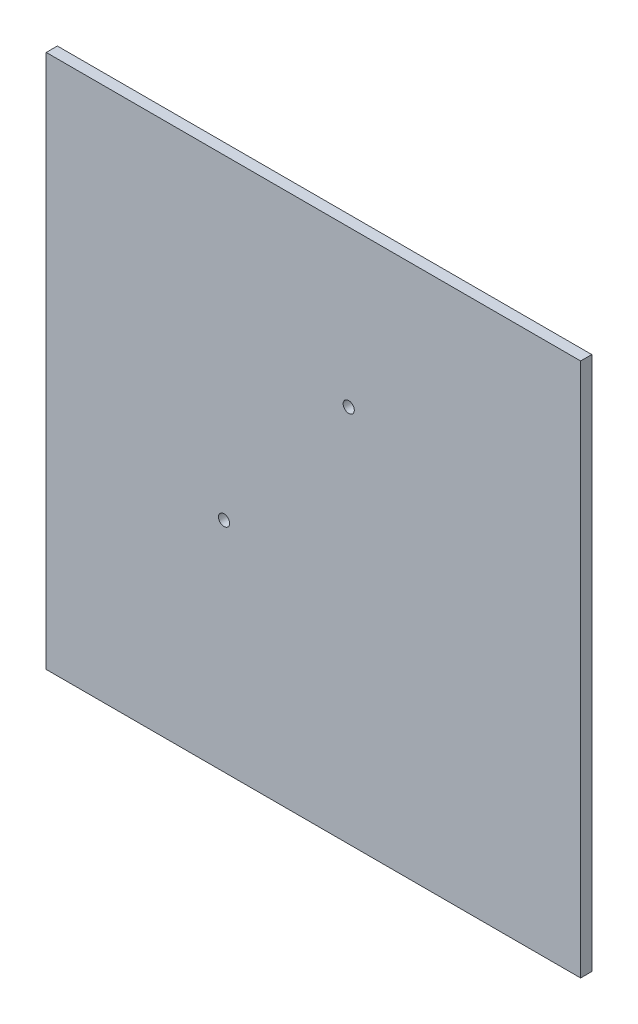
from build123d import *

# Parameters (mm, degrees)
SKETCH1_W           = 152.4
SKETCH1_H           = 152.4
SKETCH1_R           = 1.5875
BOSS_EXTRUDE1_DEPTH = 3.175


with BuildPart() as part:
    # Sketch1 → Boss-Extrude1 (new body)
    with BuildSketch(Plane.XY):
        with Locations((76.2, 76.2)):
            Rectangle(SKETCH1_W, SKETCH1_H)
        with Locations((50.704150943, 62.233423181)):
            Circle(SKETCH1_R, mode=Mode.SUBTRACT)
        with Locations((86.264150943, 107.953423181)):
            Circle(SKETCH1_R, mode=Mode.SUBTRACT)
    extrude(amount=BOSS_EXTRUDE1_DEPTH)


solid = part.part
